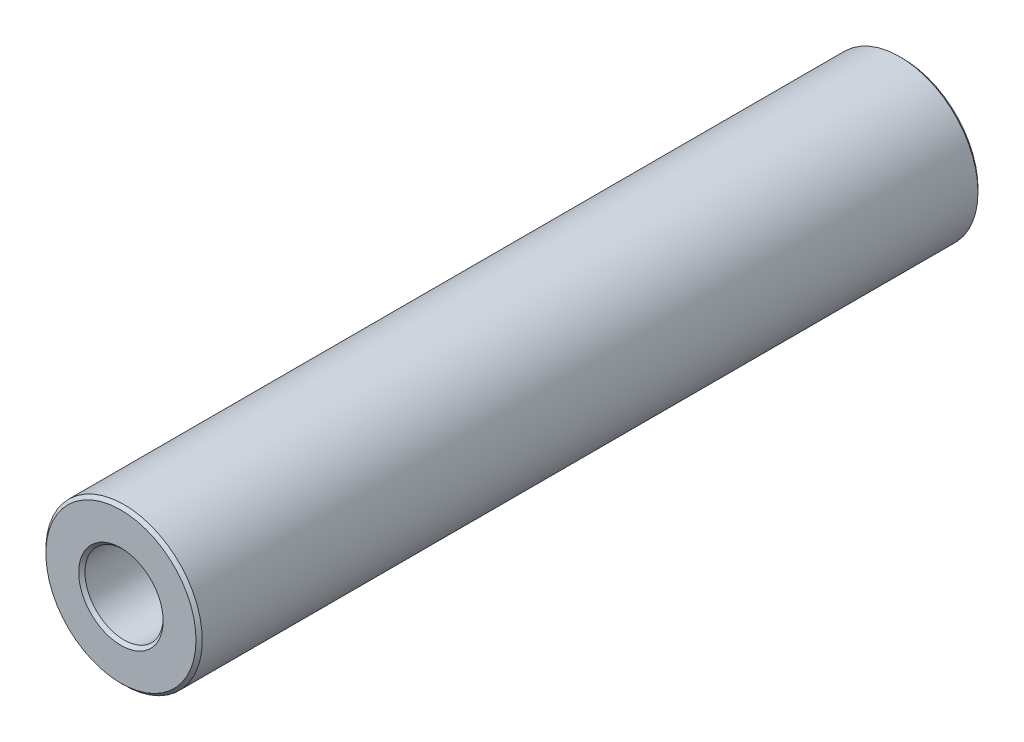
ISO-10303-21;
HEADER;
FILE_DESCRIPTION(('STEP AP214'),'2;1');
FILE_NAME('part.step','',(''),(''),'','','');
FILE_SCHEMA(('AUTOMOTIVE_DESIGN { 1 0 10303 214 1 1 1 1 }'));
ENDSEC;
DATA;
#1=APPLICATION_CONTEXT('core data for automotive mechanical design processes');
#2=APPLICATION_PROTOCOL_DEFINITION('international standard','automotive_design',2000,#1);
#3=PRODUCT_CONTEXT('',#1,'mechanical');
#4=PRODUCT('Part','Part','',(#3));
#5=PRODUCT_RELATED_PRODUCT_CATEGORY('part','',(#4));
#6=PRODUCT_DEFINITION_FORMATION('','',#4);
#7=PRODUCT_DEFINITION_CONTEXT('part definition',#1,'design');
#8=PRODUCT_DEFINITION('design','',#6,#7);
#9=PRODUCT_DEFINITION_SHAPE('','',#8);
#10=(LENGTH_UNIT() NAMED_UNIT(*) SI_UNIT(.MILLI.,.METRE.));
#11=(NAMED_UNIT(*) PLANE_ANGLE_UNIT() SI_UNIT($,.RADIAN.));
#12=(NAMED_UNIT(*) SI_UNIT($,.STERADIAN.) SOLID_ANGLE_UNIT());
#13=UNCERTAINTY_MEASURE_WITH_UNIT(LENGTH_MEASURE(1.E-05),#10,'distance_accuracy_value','');
#14=(GEOMETRIC_REPRESENTATION_CONTEXT(3) GLOBAL_UNCERTAINTY_ASSIGNED_CONTEXT((#13)) GLOBAL_UNIT_ASSIGNED_CONTEXT((#10,
#11,#12)) REPRESENTATION_CONTEXT('',''));
#15=CARTESIAN_POINT('',(0.,0.,0.));
#16=DIRECTION('',(0.,0.,1.));
#17=DIRECTION('',(1.,0.,0.));
#18=AXIS2_PLACEMENT_3D('',#15,#16,#17);
#19=CARTESIAN_POINT('',(0.,0.,12.5));
#20=DIRECTION('',(0.,0.,1.));
#21=DIRECTION('',(1.,0.,0.));
#22=AXIS2_PLACEMENT_3D('',#19,#20,#21);
#23=PLANE('',#22);
#24=CARTESIAN_POINT('',(0.,0.,12.5));
#25=DIRECTION('',(0.,0.,1.));
#26=DIRECTION('',(1.,0.,0.));
#27=AXIS2_PLACEMENT_3D('',#24,#25,#26);
#28=CIRCLE('',#27,1.35);
#29=CARTESIAN_POINT('',(1.35,0.,12.5));
#30=VERTEX_POINT('',#29);
#31=EDGE_CURVE('E10',#30,#30,#28,.F.);
#32=ORIENTED_EDGE('',*,*,#31,.T.);
#33=EDGE_LOOP('',(#32));
#34=FACE_BOUND('',#33,.T.);
#35=CARTESIAN_POINT('',(0.,0.,12.5));
#36=DIRECTION('',(0.,0.,1.));
#37=DIRECTION('',(1.,0.,0.));
#38=AXIS2_PLACEMENT_3D('',#35,#36,#37);
#39=CIRCLE('',#38,2.4);
#40=CARTESIAN_POINT('',(2.4,0.,12.5));
#41=VERTEX_POINT('',#40);
#42=EDGE_CURVE('E45',#41,#41,#39,.T.);
#43=ORIENTED_EDGE('',*,*,#42,.T.);
#44=EDGE_LOOP('',(#43));
#45=FACE_BOUND('',#44,.T.);
#46=ADVANCED_FACE('F37',(#34,#45),#23,.T.);
#47=CARTESIAN_POINT('',(0.,0.,-12.5));
#48=DIRECTION('',(0.,0.,1.));
#49=DIRECTION('',(1.,0.,0.));
#50=AXIS2_PLACEMENT_3D('',#47,#48,#49);
#51=PLANE('',#50);
#52=CARTESIAN_POINT('',(0.,0.,-12.5));
#53=DIRECTION('',(0.,0.,1.));
#54=DIRECTION('',(1.,0.,0.));
#55=AXIS2_PLACEMENT_3D('',#52,#53,#54);
#56=CIRCLE('',#55,2.4);
#57=CARTESIAN_POINT('',(2.4,0.,-12.5));
#58=VERTEX_POINT('',#57);
#59=EDGE_CURVE('E63',#58,#58,#56,.F.);
#60=ORIENTED_EDGE('',*,*,#59,.T.);
#61=EDGE_LOOP('',(#60));
#62=FACE_BOUND('',#61,.T.);
#63=CARTESIAN_POINT('',(0.,0.,-12.5));
#64=DIRECTION('',(0.,0.,1.));
#65=DIRECTION('',(1.,0.,0.));
#66=AXIS2_PLACEMENT_3D('',#63,#64,#65);
#67=CIRCLE('',#66,1.35);
#68=CARTESIAN_POINT('',(1.35,0.,-12.5));
#69=VERTEX_POINT('',#68);
#70=EDGE_CURVE('E66',#69,#69,#67,.T.);
#71=ORIENTED_EDGE('',*,*,#70,.T.);
#72=EDGE_LOOP('',(#71));
#73=FACE_BOUND('',#72,.T.);
#74=ADVANCED_FACE('F89',(#62,#73),#51,.F.);
#75=CARTESIAN_POINT('',(0.,0.,12.5));
#76=DIRECTION('',(0.,0.,-1.));
#77=DIRECTION('',(-1.,0.,0.));
#78=AXIS2_PLACEMENT_3D('',#75,#76,#77);
#79=CYLINDRICAL_SURFACE('',#78,2.5);
#80=CARTESIAN_POINT('',(0.,0.,-12.4));
#81=DIRECTION('',(0.,0.,1.));
#82=DIRECTION('',(1.,0.,0.));
#83=AXIS2_PLACEMENT_3D('',#80,#81,#82);
#84=CIRCLE('',#83,2.5);
#85=CARTESIAN_POINT('',(2.5,0.,-12.4));
#86=VERTEX_POINT('',#85);
#87=EDGE_CURVE('E70',#86,#86,#84,.T.);
#88=ORIENTED_EDGE('',*,*,#87,.T.);
#89=EDGE_LOOP('',(#88));
#90=FACE_BOUND('',#89,.T.);
#91=CARTESIAN_POINT('',(0.,0.,12.4));
#92=DIRECTION('',(0.,0.,1.));
#93=DIRECTION('',(1.,0.,0.));
#94=AXIS2_PLACEMENT_3D('',#91,#92,#93);
#95=CIRCLE('',#94,2.5);
#96=CARTESIAN_POINT('',(2.5,0.,12.4));
#97=VERTEX_POINT('',#96);
#98=EDGE_CURVE('E74',#97,#97,#95,.F.);
#99=ORIENTED_EDGE('',*,*,#98,.T.);
#100=EDGE_LOOP('',(#99));
#101=FACE_BOUND('',#100,.T.);
#102=ADVANCED_FACE('F78',(#90,#101),#79,.T.);
#103=CARTESIAN_POINT('',(0.,0.,12.5));
#104=DIRECTION('',(0.,0.,-1.));
#105=DIRECTION('',(-1.,0.,0.));
#106=AXIS2_PLACEMENT_3D('',#103,#104,#105);
#107=CYLINDRICAL_SURFACE('',#106,1.25);
#108=CARTESIAN_POINT('',(0.,0.,-12.4));
#109=DIRECTION('',(0.,0.,1.));
#110=DIRECTION('',(1.,0.,0.));
#111=AXIS2_PLACEMENT_3D('',#108,#109,#110);
#112=CIRCLE('',#111,1.25);
#113=CARTESIAN_POINT('',(1.25,0.,-12.4));
#114=VERTEX_POINT('',#113);
#115=EDGE_CURVE('E51',#114,#114,#112,.F.);
#116=ORIENTED_EDGE('',*,*,#115,.T.);
#117=EDGE_LOOP('',(#116));
#118=FACE_BOUND('',#117,.T.);
#119=CARTESIAN_POINT('',(0.,0.,12.4));
#120=DIRECTION('',(0.,0.,1.));
#121=DIRECTION('',(1.,0.,0.));
#122=AXIS2_PLACEMENT_3D('',#119,#120,#121);
#123=CIRCLE('',#122,1.25);
#124=CARTESIAN_POINT('',(1.25,0.,12.4));
#125=VERTEX_POINT('',#124);
#126=EDGE_CURVE('E57',#125,#125,#123,.T.);
#127=ORIENTED_EDGE('',*,*,#126,.T.);
#128=EDGE_LOOP('',(#127));
#129=FACE_BOUND('',#128,.T.);
#130=ADVANCED_FACE('F97',(#118,#129),#107,.F.);
#131=CARTESIAN_POINT('',(0.,0.,-12.4));
#132=DIRECTION('',(0.,0.,1.));
#133=DIRECTION('',(1.,0.,0.));
#134=AXIS2_PLACEMENT_3D('',#131,#132,#133);
#135=CONICAL_SURFACE('',#134,2.5,0.785398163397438);
#136=ORIENTED_EDGE('',*,*,#59,.F.);
#137=EDGE_LOOP('',(#136));
#138=FACE_BOUND('',#137,.T.);
#139=ORIENTED_EDGE('',*,*,#87,.F.);
#140=EDGE_LOOP('',(#139));
#141=FACE_BOUND('',#140,.T.);
#142=ADVANCED_FACE('F102',(#138,#141),#135,.T.);
#143=CARTESIAN_POINT('',(0.,0.,-12.5));
#144=DIRECTION('',(0.,0.,-1.));
#145=DIRECTION('',(-1.,0.,0.));
#146=AXIS2_PLACEMENT_3D('',#143,#144,#145);
#147=CONICAL_SURFACE('',#146,1.35,0.785398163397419);
#148=ORIENTED_EDGE('',*,*,#115,.F.);
#149=EDGE_LOOP('',(#148));
#150=FACE_BOUND('',#149,.T.);
#151=ORIENTED_EDGE('',*,*,#70,.F.);
#152=EDGE_LOOP('',(#151));
#153=FACE_BOUND('',#152,.T.);
#154=ADVANCED_FACE('F86',(#150,#153),#147,.F.);
#155=CARTESIAN_POINT('',(0.,0.,12.4));
#156=DIRECTION('',(0.,0.,1.));
#157=DIRECTION('',(1.,0.,0.));
#158=AXIS2_PLACEMENT_3D('',#155,#156,#157);
#159=CONICAL_SURFACE('',#158,1.25,0.785398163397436);
#160=ORIENTED_EDGE('',*,*,#31,.F.);
#161=EDGE_LOOP('',(#160));
#162=FACE_BOUND('',#161,.T.);
#163=ORIENTED_EDGE('',*,*,#126,.F.);
#164=EDGE_LOOP('',(#163));
#165=FACE_BOUND('',#164,.T.);
#166=ADVANCED_FACE('F82',(#162,#165),#159,.F.);
#167=CARTESIAN_POINT('',(0.,0.,12.5));
#168=DIRECTION('',(0.,0.,-1.));
#169=DIRECTION('',(-1.,0.,0.));
#170=AXIS2_PLACEMENT_3D('',#167,#168,#169);
#171=CONICAL_SURFACE('',#170,2.4,0.785398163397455);
#172=ORIENTED_EDGE('',*,*,#98,.F.);
#173=EDGE_LOOP('',(#172));
#174=FACE_BOUND('',#173,.T.);
#175=ORIENTED_EDGE('',*,*,#42,.F.);
#176=EDGE_LOOP('',(#175));
#177=FACE_BOUND('',#176,.T.);
#178=ADVANCED_FACE('F39',(#174,#177),#171,.T.);
#179=CLOSED_SHELL('',(#46,#74,#102,#130,#142,#154,#166,#178));
#180=MANIFOLD_SOLID_BREP('B2',#179);
#181=ADVANCED_BREP_SHAPE_REPRESENTATION('',(#18,#180),#14);
#182=SHAPE_DEFINITION_REPRESENTATION(#9,#181);
ENDSEC;
END-ISO-10303-21;
